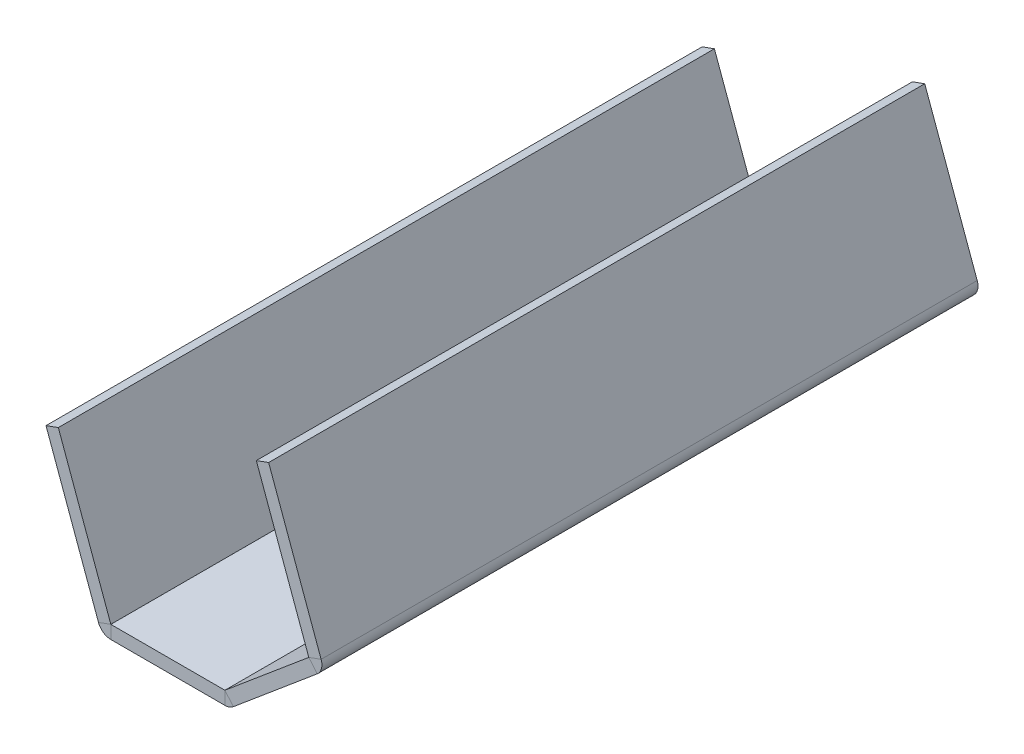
ISO-10303-21;
HEADER;
FILE_DESCRIPTION(('STEP AP214'),'2;1');
FILE_NAME('part.step','',(''),(''),'','','');
FILE_SCHEMA(('AUTOMOTIVE_DESIGN { 1 0 10303 214 1 1 1 1 }'));
ENDSEC;
DATA;
#1=APPLICATION_CONTEXT('core data for automotive mechanical design processes');
#2=APPLICATION_PROTOCOL_DEFINITION('international standard','automotive_design',2000,#1);
#3=PRODUCT_CONTEXT('',#1,'mechanical');
#4=PRODUCT('Part','Part','',(#3));
#5=PRODUCT_RELATED_PRODUCT_CATEGORY('part','',(#4));
#6=PRODUCT_DEFINITION_FORMATION('','',#4);
#7=PRODUCT_DEFINITION_CONTEXT('part definition',#1,'design');
#8=PRODUCT_DEFINITION('design','',#6,#7);
#9=PRODUCT_DEFINITION_SHAPE('','',#8);
#10=(LENGTH_UNIT() NAMED_UNIT(*) SI_UNIT(.MILLI.,.METRE.));
#11=(NAMED_UNIT(*) PLANE_ANGLE_UNIT() SI_UNIT($,.RADIAN.));
#12=(NAMED_UNIT(*) SI_UNIT($,.STERADIAN.) SOLID_ANGLE_UNIT());
#13=UNCERTAINTY_MEASURE_WITH_UNIT(LENGTH_MEASURE(1.E-05),#10,'distance_accuracy_value','');
#14=(GEOMETRIC_REPRESENTATION_CONTEXT(3) GLOBAL_UNCERTAINTY_ASSIGNED_CONTEXT((#13)) GLOBAL_UNIT_ASSIGNED_CONTEXT((#10,
#11,#12)) REPRESENTATION_CONTEXT('',''));
#15=CARTESIAN_POINT('',(0.,0.,0.));
#16=DIRECTION('',(0.,0.,1.));
#17=DIRECTION('',(1.,0.,0.));
#18=AXIS2_PLACEMENT_3D('',#15,#16,#17);
#19=CARTESIAN_POINT('',(20.6579372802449,1.93980959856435,-40.));
#20=DIRECTION('',(0.34202014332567,-0.939692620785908,0.));
#21=DIRECTION('',(0.939692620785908,0.34202014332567,0.));
#22=AXIS2_PLACEMENT_3D('',#19,#20,#21);
#23=CYLINDRICAL_SURFACE('',#22,0.00499999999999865);
#24=CARTESIAN_POINT('',(20.6579372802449,1.93980959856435,-40.));
#25=DIRECTION('',(-0.34202014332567,0.939692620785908,0.));
#26=DIRECTION('',(-0.939692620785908,-0.34202014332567,0.));
#27=AXIS2_PLACEMENT_3D('',#24,#25,#26);
#28=CIRCLE('',#27,0.00499999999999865);
#29=CARTESIAN_POINT('',(20.653238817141,1.93809949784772,-40.));
#30=VERTEX_POINT('',#29);
#31=EDGE_CURVE('E12',#30,#30,#28,.T.);
#32=ORIENTED_EDGE('',*,*,#31,.F.);
#33=EDGE_LOOP('',(#32));
#34=FACE_BOUND('',#33,.T.);
#35=CARTESIAN_POINT('',(20.9999574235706,1.00011697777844,-40.));
#36=DIRECTION('',(-0.34202014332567,0.939692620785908,0.));
#37=DIRECTION('',(-0.939692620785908,-0.34202014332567,0.));
#38=AXIS2_PLACEMENT_3D('',#35,#36,#37);
#39=CIRCLE('',#38,0.00499999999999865);
#40=CARTESIAN_POINT('',(20.9952589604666,0.998406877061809,-40.));
#41=VERTEX_POINT('',#40);
#42=EDGE_CURVE('E83',#41,#41,#39,.T.);
#43=ORIENTED_EDGE('',*,*,#42,.T.);
#44=EDGE_LOOP('',(#43));
#45=FACE_BOUND('',#44,.T.);
#46=ADVANCED_FACE('F80',(#34,#45),#23,.T.);
#47=CARTESIAN_POINT('',(20.6579372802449,1.93980959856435,-40.));
#48=DIRECTION('',(-0.34202014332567,0.939692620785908,0.));
#49=DIRECTION('',(-0.939692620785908,-0.34202014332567,0.));
#50=AXIS2_PLACEMENT_3D('',#47,#48,#49);
#51=PLANE('',#50);
#52=ORIENTED_EDGE('',*,*,#31,.T.);
#53=EDGE_LOOP('',(#52));
#54=FACE_BOUND('',#53,.T.);
#55=ADVANCED_FACE('F95',(#54),#51,.T.);
#56=CARTESIAN_POINT('',(20.9999574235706,1.00011697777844,-40.));
#57=DIRECTION('',(-0.34202014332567,0.939692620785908,0.));
#58=DIRECTION('',(-0.939692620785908,-0.34202014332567,0.));
#59=AXIS2_PLACEMENT_3D('',#56,#57,#58);
#60=PLANE('',#59);
#61=ORIENTED_EDGE('',*,*,#42,.F.);
#62=EDGE_LOOP('',(#61));
#63=FACE_BOUND('',#62,.T.);
#64=ADVANCED_FACE('F93',(#63),#60,.F.);
#65=CLOSED_SHELL('',(#46,#55,#64));
#66=MANIFOLD_SOLID_BREP('B2',#65);
#67=CARTESIAN_POINT('',(20.6579372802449,1.93980959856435,-10.));
#68=DIRECTION('',(0.34202014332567,-0.939692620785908,0.));
#69=DIRECTION('',(0.939692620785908,0.34202014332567,0.));
#70=AXIS2_PLACEMENT_3D('',#67,#68,#69);
#71=CYLINDRICAL_SURFACE('',#70,0.0050000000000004);
#72=CARTESIAN_POINT('',(20.6579372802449,1.93980959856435,-10.));
#73=DIRECTION('',(-0.34202014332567,0.939692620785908,0.));
#74=DIRECTION('',(-0.939692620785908,-0.34202014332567,0.));
#75=AXIS2_PLACEMENT_3D('',#72,#73,#74);
#76=CIRCLE('',#75,0.0050000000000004);
#77=CARTESIAN_POINT('',(20.653238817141,1.93809949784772,-10.));
#78=VERTEX_POINT('',#77);
#79=EDGE_CURVE('E79',#78,#78,#76,.T.);
#80=ORIENTED_EDGE('',*,*,#79,.F.);
#81=EDGE_LOOP('',(#80));
#82=FACE_BOUND('',#81,.T.);
#83=CARTESIAN_POINT('',(20.9999574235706,1.00011697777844,-10.));
#84=DIRECTION('',(-0.34202014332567,0.939692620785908,0.));
#85=DIRECTION('',(-0.939692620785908,-0.34202014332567,0.));
#86=AXIS2_PLACEMENT_3D('',#83,#84,#85);
#87=CIRCLE('',#86,0.0050000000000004);
#88=CARTESIAN_POINT('',(20.9952589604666,0.99840687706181,-10.));
#89=VERTEX_POINT('',#88);
#90=EDGE_CURVE('E133',#89,#89,#87,.T.);
#91=ORIENTED_EDGE('',*,*,#90,.T.);
#92=EDGE_LOOP('',(#91));
#93=FACE_BOUND('',#92,.T.);
#94=ADVANCED_FACE('F130',(#82,#93),#71,.T.);
#95=CARTESIAN_POINT('',(20.6579372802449,1.93980959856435,-10.));
#96=DIRECTION('',(-0.34202014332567,0.939692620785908,0.));
#97=DIRECTION('',(-0.939692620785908,-0.34202014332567,0.));
#98=AXIS2_PLACEMENT_3D('',#95,#96,#97);
#99=PLANE('',#98);
#100=ORIENTED_EDGE('',*,*,#79,.T.);
#101=EDGE_LOOP('',(#100));
#102=FACE_BOUND('',#101,.T.);
#103=ADVANCED_FACE('F145',(#102),#99,.T.);
#104=CARTESIAN_POINT('',(20.9999574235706,1.00011697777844,-10.));
#105=DIRECTION('',(-0.34202014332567,0.939692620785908,0.));
#106=DIRECTION('',(-0.939692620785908,-0.34202014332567,0.));
#107=AXIS2_PLACEMENT_3D('',#104,#105,#106);
#108=PLANE('',#107);
#109=ORIENTED_EDGE('',*,*,#90,.F.);
#110=EDGE_LOOP('',(#109));
#111=FACE_BOUND('',#110,.T.);
#112=ADVANCED_FACE('F143',(#111),#108,.F.);
#113=CLOSED_SHELL('',(#94,#103,#112));
#114=MANIFOLD_SOLID_BREP('B7',#113);
#115=CARTESIAN_POINT('',(4.6456895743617,-12.7228958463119,-50.));
#116=DIRECTION('',(0.,0.,1.));
#117=DIRECTION('',(0.766044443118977,0.642787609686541,0.));
#118=AXIS2_PLACEMENT_3D('',#115,#116,#117);
#119=PLANE('',#118);
#120=DIRECTION('',(-0.766044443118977,-0.64278760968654,0.));
#121=VECTOR('',#120,1.);
#122=CARTESIAN_POINT('',(5.28847718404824,-13.4889402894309,-50.));
#123=LINE('',#122,#121);
#124=CARTESIAN_POINT('',(28.0353675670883,5.59796704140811,-50.));
#125=VERTEX_POINT('',#124);
#126=CARTESIAN_POINT('',(21.6430664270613,0.234189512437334,-50.));
#127=VERTEX_POINT('',#126);
#128=EDGE_CURVE('E703',#125,#127,#123,.T.);
#129=ORIENTED_EDGE('',*,*,#128,.T.);
#130=DIRECTION('',(-0.642787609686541,0.766044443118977,0.));
#131=VECTOR('',#130,1.);
#132=CARTESIAN_POINT('',(21.0002788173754,1.00023395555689,-50.));
#133=LINE('',#132,#131);
#134=CARTESIAN_POINT('',(21.0002788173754,1.00023395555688,-50.));
#135=VERTEX_POINT('',#134);
#136=EDGE_CURVE('E443',#127,#135,#133,.T.);
#137=ORIENTED_EDGE('',*,*,#136,.T.);
#138=DIRECTION('',(-0.766044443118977,-0.64278760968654,0.));
#139=VECTOR('',#138,1.);
#140=CARTESIAN_POINT('',(4.6456895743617,-12.7228958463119,-50.));
#141=LINE('',#140,#139);
#142=CARTESIAN_POINT('',(27.3925799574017,6.36401148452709,-50.));
#143=VERTEX_POINT('',#142);
#144=EDGE_CURVE('E692',#143,#135,#141,.T.);
#145=ORIENTED_EDGE('',*,*,#144,.F.);
#146=DIRECTION('',(-0.642787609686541,0.766044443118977,0.));
#147=VECTOR('',#146,1.);
#148=CARTESIAN_POINT('',(27.3925799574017,6.36401148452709,-50.));
#149=LINE('',#148,#147);
#150=EDGE_CURVE('E444',#125,#143,#149,.T.);
#151=ORIENTED_EDGE('',*,*,#150,.F.);
#152=EDGE_LOOP('',(#129,#137,#145,#151));
#153=FACE_BOUND('',#152,.T.);
#154=ADVANCED_FACE('F170',(#153),#119,.F.);
#155=CARTESIAN_POINT('',(4.6456895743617,-12.7228958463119,0.));
#156=DIRECTION('',(0.,0.,-1.));
#157=DIRECTION('',(-0.766044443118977,-0.642787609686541,0.));
#158=AXIS2_PLACEMENT_3D('',#155,#156,#157);
#159=PLANE('',#158);
#160=DIRECTION('',(0.766044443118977,0.64278760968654,0.));
#161=VECTOR('',#160,1.);
#162=CARTESIAN_POINT('',(4.6456895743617,-12.7228958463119,0.));
#163=LINE('',#162,#161);
#164=CARTESIAN_POINT('',(21.0002788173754,1.00023395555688,0.));
#165=VERTEX_POINT('',#164);
#166=CARTESIAN_POINT('',(27.3925799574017,6.36401148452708,0.));
#167=VERTEX_POINT('',#166);
#168=EDGE_CURVE('E704',#165,#167,#163,.T.);
#169=ORIENTED_EDGE('',*,*,#168,.F.);
#170=DIRECTION('',(0.642787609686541,-0.766044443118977,0.));
#171=VECTOR('',#170,1.);
#172=CARTESIAN_POINT('',(21.0002788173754,1.00023395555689,0.));
#173=LINE('',#172,#171);
#174=CARTESIAN_POINT('',(21.6430664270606,0.23418951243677,0.));
#175=VERTEX_POINT('',#174);
#176=EDGE_CURVE('E128',#165,#175,#173,.T.);
#177=ORIENTED_EDGE('',*,*,#176,.T.);
#178=DIRECTION('',(0.766044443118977,0.64278760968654,0.));
#179=VECTOR('',#178,1.);
#180=CARTESIAN_POINT('',(5.28847718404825,-13.4889402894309,0.));
#181=LINE('',#180,#179);
#182=CARTESIAN_POINT('',(28.0353675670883,5.59796704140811,0.));
#183=VERTEX_POINT('',#182);
#184=EDGE_CURVE('E369',#175,#183,#181,.T.);
#185=ORIENTED_EDGE('',*,*,#184,.T.);
#186=DIRECTION('',(0.642787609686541,-0.766044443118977,0.));
#187=VECTOR('',#186,1.);
#188=CARTESIAN_POINT('',(27.3925799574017,6.36401148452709,0.));
#189=LINE('',#188,#187);
#190=EDGE_CURVE('E691',#167,#183,#189,.T.);
#191=ORIENTED_EDGE('',*,*,#190,.F.);
#192=EDGE_LOOP('',(#169,#177,#185,#191));
#193=FACE_BOUND('',#192,.T.);
#194=ADVANCED_FACE('F423',(#193),#159,.F.);
#195=CARTESIAN_POINT('',(4.6456895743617,-12.7228958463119,-50.));
#196=DIRECTION('',(0.642787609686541,-0.766044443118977,0.));
#197=DIRECTION('',(0.,0.,-1.));
#198=AXIS2_PLACEMENT_3D('',#195,#196,#197);
#199=PLANE('',#198);
#200=ORIENTED_EDGE('',*,*,#144,.T.);
#201=DIRECTION('',(0.,0.,1.));
#202=VECTOR('',#201,1.);
#203=CARTESIAN_POINT('',(21.0002788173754,1.00023395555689,-50.));
#204=LINE('',#203,#202);
#205=CARTESIAN_POINT('',(21.0002788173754,1.00023395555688,-41.7147651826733));
#206=VERTEX_POINT('',#205);
#207=EDGE_CURVE('E366',#135,#206,#204,.T.);
#208=ORIENTED_EDGE('',*,*,#207,.T.);
#209=CARTESIAN_POINT('',(20.7326228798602,0.775643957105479,-40.));
#210=DIRECTION('',(-0.642787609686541,0.766044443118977,0.));
#211=DIRECTION('',(0.,0.,1.));
#212=AXIS2_PLACEMENT_3D('',#209,#210,#211);
#213=CIRCLE('',#212,1.75);
#214=CARTESIAN_POINT('',(21.0002788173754,1.00023395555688,-38.2852348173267));
#215=VERTEX_POINT('',#214);
#216=EDGE_CURVE('E363',#215,#206,#213,.T.);
#217=ORIENTED_EDGE('',*,*,#216,.F.);
#218=DIRECTION('',(0.,0.,1.));
#219=VECTOR('',#218,1.);
#220=CARTESIAN_POINT('',(21.0002788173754,1.00023395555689,-50.));
#221=LINE('',#220,#219);
#222=CARTESIAN_POINT('',(21.0002788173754,1.00023395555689,-11.7147651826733));
#223=VERTEX_POINT('',#222);
#224=EDGE_CURVE('E335',#215,#223,#221,.T.);
#225=ORIENTED_EDGE('',*,*,#224,.T.);
#226=CARTESIAN_POINT('',(20.7326228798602,0.775643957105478,-10.));
#227=DIRECTION('',(-0.642787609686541,0.766044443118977,0.));
#228=DIRECTION('',(0.,0.,1.));
#229=AXIS2_PLACEMENT_3D('',#226,#227,#228);
#230=CIRCLE('',#229,1.75);
#231=CARTESIAN_POINT('',(21.0002788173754,1.00023395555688,-8.28523481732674));
#232=VERTEX_POINT('',#231);
#233=EDGE_CURVE('E389',#232,#223,#230,.T.);
#234=ORIENTED_EDGE('',*,*,#233,.F.);
#235=DIRECTION('',(0.,0.,1.));
#236=VECTOR('',#235,1.);
#237=CARTESIAN_POINT('',(21.0002788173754,1.00023395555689,-50.));
#238=LINE('',#237,#236);
#239=EDGE_CURVE('E410',#232,#165,#238,.T.);
#240=ORIENTED_EDGE('',*,*,#239,.T.);
#241=ORIENTED_EDGE('',*,*,#168,.T.);
#242=DIRECTION('',(0.,0.,1.));
#243=VECTOR('',#242,1.);
#244=CARTESIAN_POINT('',(27.3925799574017,6.36401148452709,-50.));
#245=LINE('',#244,#243);
#246=EDGE_CURVE('E688',#143,#167,#245,.T.);
#247=ORIENTED_EDGE('',*,*,#246,.F.);
#248=EDGE_LOOP('',(#200,#208,#217,#225,#234,#240,#241,#247));
#249=FACE_BOUND('',#248,.T.);
#250=ADVANCED_FACE('F365',(#249),#199,.F.);
#251=CARTESIAN_POINT('',(5.28847718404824,-13.4889402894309,-50.));
#252=DIRECTION('',(0.642787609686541,-0.766044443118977,0.));
#253=DIRECTION('',(0.,0.,-1.));
#254=AXIS2_PLACEMENT_3D('',#251,#252,#253);
#255=PLANE('',#254);
#256=DIRECTION('',(0.,0.,1.));
#257=VECTOR('',#256,1.);
#258=CARTESIAN_POINT('',(21.643066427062,0.234189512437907,-50.));
#259=LINE('',#258,#257);
#260=CARTESIAN_POINT('',(21.6430664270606,0.234189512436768,-41.7147651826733));
#261=VERTEX_POINT('',#260);
#262=EDGE_CURVE('E447',#127,#261,#259,.T.);
#263=ORIENTED_EDGE('',*,*,#262,.F.);
#264=ORIENTED_EDGE('',*,*,#128,.F.);
#265=DIRECTION('',(0.,0.,1.));
#266=VECTOR('',#265,1.);
#267=CARTESIAN_POINT('',(28.0353675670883,5.59796704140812,-50.));
#268=LINE('',#267,#266);
#269=EDGE_CURVE('E695',#125,#183,#268,.T.);
#270=ORIENTED_EDGE('',*,*,#269,.T.);
#271=ORIENTED_EDGE('',*,*,#184,.F.);
#272=DIRECTION('',(0.,0.,1.));
#273=VECTOR('',#272,1.);
#274=CARTESIAN_POINT('',(21.643066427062,0.234189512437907,-50.));
#275=LINE('',#274,#273);
#276=CARTESIAN_POINT('',(21.6430664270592,0.234189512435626,-8.28523481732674));
#277=VERTEX_POINT('',#276);
#278=EDGE_CURVE('E181',#277,#175,#275,.T.);
#279=ORIENTED_EDGE('',*,*,#278,.F.);
#280=CARTESIAN_POINT('',(21.3754104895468,0.00959951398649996,-10.));
#281=DIRECTION('',(-0.642787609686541,0.766044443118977,0.));
#282=DIRECTION('',(0.,0.,1.));
#283=AXIS2_PLACEMENT_3D('',#280,#281,#282);
#284=CIRCLE('',#283,1.75);
#285=CARTESIAN_POINT('',(21.6430664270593,0.234189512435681,-11.7147651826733));
#286=VERTEX_POINT('',#285);
#287=EDGE_CURVE('E396',#277,#286,#284,.T.);
#288=ORIENTED_EDGE('',*,*,#287,.T.);
#289=DIRECTION('',(0.,0.,1.));
#290=VECTOR('',#289,1.);
#291=CARTESIAN_POINT('',(21.643066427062,0.234189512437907,-50.));
#292=LINE('',#291,#290);
#293=CARTESIAN_POINT('',(21.6430664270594,0.234189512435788,-38.2852348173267));
#294=VERTEX_POINT('',#293);
#295=EDGE_CURVE('E376',#294,#286,#292,.T.);
#296=ORIENTED_EDGE('',*,*,#295,.F.);
#297=CARTESIAN_POINT('',(21.3754104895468,0.00959951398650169,-40.));
#298=DIRECTION('',(-0.642787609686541,0.766044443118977,0.));
#299=DIRECTION('',(0.,0.,1.));
#300=AXIS2_PLACEMENT_3D('',#297,#298,#299);
#301=CIRCLE('',#300,1.75);
#302=EDGE_CURVE('E370',#294,#261,#301,.T.);
#303=ORIENTED_EDGE('',*,*,#302,.T.);
#304=EDGE_LOOP('',(#263,#264,#270,#271,#279,#288,#296,#303));
#305=FACE_BOUND('',#304,.T.);
#306=ADVANCED_FACE('F752',(#305),#255,.T.);
#307=CARTESIAN_POINT('',(20.7326228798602,0.775643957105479,-40.));
#308=DIRECTION('',(0.642787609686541,-0.766044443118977,0.));
#309=DIRECTION('',(0.,0.,-1.));
#310=AXIS2_PLACEMENT_3D('',#307,#308,#309);
#311=CYLINDRICAL_SURFACE('',#310,1.75);
#312=CARTESIAN_POINT('',(21.0002788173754,1.00023395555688,-38.2852348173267));
#313=CARTESIAN_POINT('',(21.6430664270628,0.234189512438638,-38.2852348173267));
#314=B_SPLINE_CURVE_WITH_KNOTS('',1,(#312,#313),.UNSPECIFIED.,.F.,.F.,(2,2),(0.,1.),.UNSPECIFIED.);
#315=EDGE_CURVE('E345',#215,#294,#314,.T.);
#316=ORIENTED_EDGE('',*,*,#315,.F.);
#317=ORIENTED_EDGE('',*,*,#216,.T.);
#318=CARTESIAN_POINT('',(21.64306642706,0.234189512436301,-41.7147651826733));
#319=CARTESIAN_POINT('',(21.0002788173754,1.00023395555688,-41.7147651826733));
#320=B_SPLINE_CURVE_WITH_KNOTS('',1,(#318,#319),.UNSPECIFIED.,.F.,.F.,(2,2),(0.,1.),.UNSPECIFIED.);
#321=EDGE_CURVE('E346',#261,#206,#320,.T.);
#322=ORIENTED_EDGE('',*,*,#321,.F.);
#323=ORIENTED_EDGE('',*,*,#302,.F.);
#324=EDGE_LOOP('',(#316,#317,#322,#323));
#325=FACE_BOUND('',#324,.T.);
#326=ADVANCED_FACE('F172',(#325),#311,.F.);
#327=CARTESIAN_POINT('',(20.7326228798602,0.775643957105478,-10.));
#328=DIRECTION('',(0.642787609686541,-0.766044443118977,0.));
#329=DIRECTION('',(0.,0.,-1.));
#330=AXIS2_PLACEMENT_3D('',#327,#328,#329);
#331=CYLINDRICAL_SURFACE('',#330,1.75);
#332=CARTESIAN_POINT('',(21.0002788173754,1.00023395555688,-8.28523481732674));
#333=CARTESIAN_POINT('',(21.6430664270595,0.234189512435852,-8.28523481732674));
#334=B_SPLINE_CURVE_WITH_KNOTS('',1,(#332,#333),.UNSPECIFIED.,.F.,.F.,(2,2),(0.,1.),.UNSPECIFIED.);
#335=EDGE_CURVE('E439',#232,#277,#334,.T.);
#336=ORIENTED_EDGE('',*,*,#335,.F.);
#337=ORIENTED_EDGE('',*,*,#233,.T.);
#338=CARTESIAN_POINT('',(21.6430664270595,0.234189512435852,-11.7147651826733));
#339=CARTESIAN_POINT('',(21.0002788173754,1.00023395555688,-11.7147651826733));
#340=B_SPLINE_CURVE_WITH_KNOTS('',1,(#338,#339),.UNSPECIFIED.,.F.,.F.,(2,2),(0.,1.),.UNSPECIFIED.);
#341=EDGE_CURVE('E393',#286,#223,#340,.T.);
#342=ORIENTED_EDGE('',*,*,#341,.F.);
#343=ORIENTED_EDGE('',*,*,#287,.F.);
#344=EDGE_LOOP('',(#336,#337,#342,#343));
#345=FACE_BOUND('',#344,.T.);
#346=ADVANCED_FACE('F412',(#345),#331,.F.);
#347=CARTESIAN_POINT('',(27.3919371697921,6.36477752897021,-50.));
#348=DIRECTION('',(0.,0.,1.));
#349=DIRECTION('',(0.766044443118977,0.642787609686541,0.));
#350=AXIS2_PLACEMENT_3D('',#347,#348,#349);
#351=PLANE('',#350);
#352=DIRECTION('',(-0.939692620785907,-0.342020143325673,0.));
#353=VECTOR('',#352,1.);
#354=CARTESIAN_POINT('',(27.3928768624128,6.36511954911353,-50.));
#355=LINE('',#354,#353);
#356=CARTESIAN_POINT('',(28.3325694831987,6.70713969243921,-50.));
#357=VERTEX_POINT('',#356);
#358=CARTESIAN_POINT('',(27.3928768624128,6.36511954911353,-50.));
#359=VERTEX_POINT('',#358);
#360=EDGE_CURVE('E652',#357,#359,#355,.T.);
#361=ORIENTED_EDGE('',*,*,#360,.F.);
#362=CARTESIAN_POINT('',(27.3919371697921,6.36477752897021,-50.));
#363=DIRECTION('',(0.,0.,-1.));
#364=DIRECTION('',(-0.766044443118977,-0.642787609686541,0.));
#365=AXIS2_PLACEMENT_3D('',#362,#363,#364);
#366=CIRCLE('',#365,1.001);
#367=EDGE_CURVE('E651',#357,#125,#366,.T.);
#368=ORIENTED_EDGE('',*,*,#367,.T.);
#369=ORIENTED_EDGE('',*,*,#150,.T.);
#370=CARTESIAN_POINT('',(27.3919371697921,6.36477752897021,-50.));
#371=DIRECTION('',(0.,0.,-1.));
#372=DIRECTION('',(-0.766044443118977,-0.642787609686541,0.));
#373=AXIS2_PLACEMENT_3D('',#370,#371,#372);
#374=CIRCLE('',#373,0.000999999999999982);
#375=EDGE_CURVE('E678',#359,#143,#374,.T.);
#376=ORIENTED_EDGE('',*,*,#375,.F.);
#377=EDGE_LOOP('',(#361,#368,#369,#376));
#378=FACE_BOUND('',#377,.T.);
#379=ADVANCED_FACE('F422',(#378),#351,.F.);
#380=CARTESIAN_POINT('',(27.3919371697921,6.36477752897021,0.));
#381=DIRECTION('',(0.,0.,-1.));
#382=DIRECTION('',(-0.766044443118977,-0.642787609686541,0.));
#383=AXIS2_PLACEMENT_3D('',#380,#381,#382);
#384=PLANE('',#383);
#385=ORIENTED_EDGE('',*,*,#190,.T.);
#386=CARTESIAN_POINT('',(27.3919371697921,6.36477752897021,0.));
#387=DIRECTION('',(0.,0.,-1.));
#388=DIRECTION('',(-0.766044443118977,-0.642787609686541,0.));
#389=AXIS2_PLACEMENT_3D('',#386,#387,#388);
#390=CIRCLE('',#389,1.001);
#391=CARTESIAN_POINT('',(28.3325694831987,6.7071396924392,0.));
#392=VERTEX_POINT('',#391);
#393=EDGE_CURVE('E681',#183,#392,#390,.F.);
#394=ORIENTED_EDGE('',*,*,#393,.T.);
#395=DIRECTION('',(0.939692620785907,0.342020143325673,0.));
#396=VECTOR('',#395,1.);
#397=CARTESIAN_POINT('',(27.3928768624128,6.36511954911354,0.));
#398=LINE('',#397,#396);
#399=CARTESIAN_POINT('',(27.3928768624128,6.36511954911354,0.));
#400=VERTEX_POINT('',#399);
#401=EDGE_CURVE('E659',#400,#392,#398,.T.);
#402=ORIENTED_EDGE('',*,*,#401,.F.);
#403=CARTESIAN_POINT('',(27.3919371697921,6.36477752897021,0.));
#404=DIRECTION('',(0.,0.,1.));
#405=DIRECTION('',(0.766044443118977,0.642787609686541,0.));
#406=AXIS2_PLACEMENT_3D('',#403,#404,#405);
#407=CIRCLE('',#406,0.000999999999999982);
#408=EDGE_CURVE('E399',#167,#400,#407,.T.);
#409=ORIENTED_EDGE('',*,*,#408,.F.);
#410=EDGE_LOOP('',(#385,#394,#402,#409));
#411=FACE_BOUND('',#410,.T.);
#412=ADVANCED_FACE('F729',(#411),#384,.F.);
#413=CARTESIAN_POINT('',(27.3919371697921,6.36477752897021,25.0137446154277));
#414=DIRECTION('',(0.,0.,-1.));
#415=DIRECTION('',(-0.766044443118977,-0.642787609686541,0.));
#416=AXIS2_PLACEMENT_3D('',#413,#414,#415);
#417=CYLINDRICAL_SURFACE('',#416,0.001);
#418=ORIENTED_EDGE('',*,*,#408,.T.);
#419=DIRECTION('',(0.,0.,1.));
#420=VECTOR('',#419,1.);
#421=CARTESIAN_POINT('',(27.3928768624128,6.36511954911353,-50.));
#422=LINE('',#421,#420);
#423=EDGE_CURVE('E666',#359,#400,#422,.T.);
#424=ORIENTED_EDGE('',*,*,#423,.F.);
#425=ORIENTED_EDGE('',*,*,#375,.T.);
#426=ORIENTED_EDGE('',*,*,#246,.T.);
#427=EDGE_LOOP('',(#418,#424,#425,#426));
#428=FACE_BOUND('',#427,.T.);
#429=ADVANCED_FACE('F725',(#428),#417,.F.);
#430=CARTESIAN_POINT('',(27.3919371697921,6.36477752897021,25.0137446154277));
#431=DIRECTION('',(0.,0.,-1.));
#432=DIRECTION('',(-0.766044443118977,-0.642787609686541,0.));
#433=AXIS2_PLACEMENT_3D('',#430,#431,#432);
#434=CYLINDRICAL_SURFACE('',#433,1.001);
#435=ORIENTED_EDGE('',*,*,#393,.F.);
#436=ORIENTED_EDGE('',*,*,#269,.F.);
#437=ORIENTED_EDGE('',*,*,#367,.F.);
#438=DIRECTION('',(0.,0.,1.));
#439=VECTOR('',#438,1.);
#440=CARTESIAN_POINT('',(28.3325694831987,6.70713969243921,-50.));
#441=LINE('',#440,#439);
#442=EDGE_CURVE('E510',#357,#392,#441,.T.);
#443=ORIENTED_EDGE('',*,*,#442,.T.);
#444=EDGE_LOOP('',(#435,#436,#437,#443));
#445=FACE_BOUND('',#444,.T.);
#446=ADVANCED_FACE('F750',(#445),#434,.T.);
#447=CARTESIAN_POINT('',(23.3933081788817,17.3538441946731,0.));
#448=DIRECTION('',(0.342020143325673,-0.939692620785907,0.));
#449=DIRECTION('',(0.,0.,1.));
#450=AXIS2_PLACEMENT_3D('',#447,#448,#449);
#451=PLANE('',#450);
#452=DIRECTION('',(0.,0.,-1.));
#453=VECTOR('',#452,1.);
#454=CARTESIAN_POINT('',(24.3330007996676,17.6958643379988,0.));
#455=LINE('',#454,#453);
#456=CARTESIAN_POINT('',(24.3330007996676,17.6958643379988,0.));
#457=VERTEX_POINT('',#456);
#458=CARTESIAN_POINT('',(24.3330007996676,17.6958643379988,-50.));
#459=VERTEX_POINT('',#458);
#460=EDGE_CURVE('E674',#457,#459,#455,.T.);
#461=ORIENTED_EDGE('',*,*,#460,.T.);
#462=DIRECTION('',(0.939692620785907,0.342020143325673,0.));
#463=VECTOR('',#462,1.);
#464=CARTESIAN_POINT('',(23.3933081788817,17.3538441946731,-50.));
#465=LINE('',#464,#463);
#466=CARTESIAN_POINT('',(23.3933081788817,17.3538441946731,-50.));
#467=VERTEX_POINT('',#466);
#468=EDGE_CURVE('E643',#467,#459,#465,.T.);
#469=ORIENTED_EDGE('',*,*,#468,.F.);
#470=DIRECTION('',(0.,0.,-1.));
#471=VECTOR('',#470,1.);
#472=CARTESIAN_POINT('',(23.3933081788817,17.3538441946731,0.));
#473=LINE('',#472,#471);
#474=CARTESIAN_POINT('',(23.3933081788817,17.3538441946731,0.));
#475=VERTEX_POINT('',#474);
#476=EDGE_CURVE('E662',#475,#467,#473,.T.);
#477=ORIENTED_EDGE('',*,*,#476,.F.);
#478=DIRECTION('',(0.939692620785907,0.342020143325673,0.));
#479=VECTOR('',#478,1.);
#480=CARTESIAN_POINT('',(23.3933081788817,17.3538441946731,0.));
#481=LINE('',#480,#479);
#482=EDGE_CURVE('E671',#475,#457,#481,.T.);
#483=ORIENTED_EDGE('',*,*,#482,.T.);
#484=EDGE_LOOP('',(#461,#469,#477,#483));
#485=FACE_BOUND('',#484,.T.);
#486=ADVANCED_FACE('F1131',(#485),#451,.F.);
#487=CARTESIAN_POINT('',(37.7581541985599,-22.113245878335,-50.));
#488=DIRECTION('',(0.939692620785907,0.342020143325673,0.));
#489=DIRECTION('',(0.,0.,-1.));
#490=AXIS2_PLACEMENT_3D('',#487,#488,#489);
#491=PLANE('',#490);
#492=DIRECTION('',(0.342020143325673,-0.939692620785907,0.));
#493=VECTOR('',#492,1.);
#494=CARTESIAN_POINT('',(37.7581541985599,-22.113245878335,-50.));
#495=LINE('',#494,#493);
#496=EDGE_CURVE('E669',#467,#359,#495,.T.);
#497=ORIENTED_EDGE('',*,*,#496,.T.);
#498=ORIENTED_EDGE('',*,*,#423,.T.);
#499=DIRECTION('',(-0.342020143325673,0.939692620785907,0.));
#500=VECTOR('',#499,1.);
#501=CARTESIAN_POINT('',(37.7581541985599,-22.113245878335,0.));
#502=LINE('',#501,#500);
#503=EDGE_CURVE('E664',#400,#475,#502,.T.);
#504=ORIENTED_EDGE('',*,*,#503,.T.);
#505=ORIENTED_EDGE('',*,*,#476,.T.);
#506=EDGE_LOOP('',(#497,#498,#504,#505));
#507=FACE_BOUND('',#506,.T.);
#508=ADVANCED_FACE('F735',(#507),#491,.F.);
#509=CARTESIAN_POINT('',(37.7581541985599,-22.113245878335,0.));
#510=DIRECTION('',(0.,0.,-1.));
#511=DIRECTION('',(0.342020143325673,-0.939692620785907,0.));
#512=AXIS2_PLACEMENT_3D('',#509,#510,#511);
#513=PLANE('',#512);
#514=ORIENTED_EDGE('',*,*,#503,.F.);
#515=ORIENTED_EDGE('',*,*,#401,.T.);
#516=DIRECTION('',(-0.342020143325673,0.939692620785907,0.));
#517=VECTOR('',#516,1.);
#518=CARTESIAN_POINT('',(38.6978468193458,-21.7712257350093,0.));
#519=LINE('',#518,#517);
#520=EDGE_CURVE('E657',#392,#457,#519,.T.);
#521=ORIENTED_EDGE('',*,*,#520,.T.);
#522=ORIENTED_EDGE('',*,*,#482,.F.);
#523=EDGE_LOOP('',(#514,#515,#521,#522));
#524=FACE_BOUND('',#523,.T.);
#525=ADVANCED_FACE('F731',(#524),#513,.F.);
#526=CARTESIAN_POINT('',(38.6978468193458,-21.7712257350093,-50.));
#527=DIRECTION('',(0.939692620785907,0.342020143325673,0.));
#528=DIRECTION('',(0.,0.,-1.));
#529=AXIS2_PLACEMENT_3D('',#526,#527,#528);
#530=PLANE('',#529);
#531=ORIENTED_EDGE('',*,*,#442,.F.);
#532=DIRECTION('',(0.342020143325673,-0.939692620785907,0.));
#533=VECTOR('',#532,1.);
#534=CARTESIAN_POINT('',(38.6978468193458,-21.7712257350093,-50.));
#535=LINE('',#534,#533);
#536=EDGE_CURVE('E655',#459,#357,#535,.T.);
#537=ORIENTED_EDGE('',*,*,#536,.F.);
#538=ORIENTED_EDGE('',*,*,#460,.F.);
#539=ORIENTED_EDGE('',*,*,#520,.F.);
#540=EDGE_LOOP('',(#531,#537,#538,#539));
#541=FACE_BOUND('',#540,.T.);
#542=ADVANCED_FACE('F1111',(#541),#530,.T.);
#543=CARTESIAN_POINT('',(37.7581541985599,-22.113245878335,-50.));
#544=DIRECTION('',(0.,0.,1.));
#545=DIRECTION('',(-0.342020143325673,0.939692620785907,0.));
#546=AXIS2_PLACEMENT_3D('',#543,#544,#545);
#547=PLANE('',#546);
#548=ORIENTED_EDGE('',*,*,#536,.T.);
#549=ORIENTED_EDGE('',*,*,#360,.T.);
#550=ORIENTED_EDGE('',*,*,#496,.F.);
#551=ORIENTED_EDGE('',*,*,#468,.T.);
#552=EDGE_LOOP('',(#548,#549,#550,#551));
#553=FACE_BOUND('',#552,.T.);
#554=ADVANCED_FACE('F740',(#553),#547,.F.);
#555=CARTESIAN_POINT('',(8.30553510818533,11.9893826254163,0.));
#556=DIRECTION('',(0.342020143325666,-0.93969262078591,0.));
#557=DIRECTION('',(0.,0.,-1.));
#558=AXIS2_PLACEMENT_3D('',#555,#556,#557);
#559=PLANE('',#558);
#560=DIRECTION('',(0.,0.,1.));
#561=VECTOR('',#560,1.);
#562=CARTESIAN_POINT('',(7.36584248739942,11.6473624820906,0.));
#563=LINE('',#562,#561);
#564=CARTESIAN_POINT('',(7.36584248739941,11.6473624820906,-50.));
#565=VERTEX_POINT('',#564);
#566=CARTESIAN_POINT('',(7.36584248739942,11.6473624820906,0.));
#567=VERTEX_POINT('',#566);
#568=EDGE_CURVE('E573',#565,#567,#563,.T.);
#569=ORIENTED_EDGE('',*,*,#568,.T.);
#570=DIRECTION('',(-0.93969262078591,-0.342020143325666,0.));
#571=VECTOR('',#570,1.);
#572=CARTESIAN_POINT('',(8.30553510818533,11.9893826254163,0.));
#573=LINE('',#572,#571);
#574=CARTESIAN_POINT('',(8.30553510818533,11.9893826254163,0.));
#575=VERTEX_POINT('',#574);
#576=EDGE_CURVE('E567',#575,#567,#573,.T.);
#577=ORIENTED_EDGE('',*,*,#576,.F.);
#578=DIRECTION('',(0.,0.,1.));
#579=VECTOR('',#578,1.);
#580=CARTESIAN_POINT('',(8.30553510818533,11.9893826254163,0.));
#581=LINE('',#580,#579);
#582=CARTESIAN_POINT('',(8.30553510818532,11.9893826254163,-50.));
#583=VERTEX_POINT('',#582);
#584=EDGE_CURVE('E555',#583,#575,#581,.T.);
#585=ORIENTED_EDGE('',*,*,#584,.F.);
#586=DIRECTION('',(-0.93969262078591,-0.342020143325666,0.));
#587=VECTOR('',#586,1.);
#588=CARTESIAN_POINT('',(8.30553510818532,11.9893826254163,-50.));
#589=LINE('',#588,#587);
#590=EDGE_CURVE('E570',#583,#565,#589,.T.);
#591=ORIENTED_EDGE('',*,*,#590,.T.);
#592=EDGE_LOOP('',(#569,#577,#585,#591));
#593=FACE_BOUND('',#592,.T.);
#594=ADVANCED_FACE('F486',(#593),#559,.F.);
#595=CARTESIAN_POINT('',(8.30553510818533,11.9893826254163,0.));
#596=DIRECTION('',(0.,0.,-1.));
#597=DIRECTION('',(-0.342020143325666,0.93969262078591,0.));
#598=AXIS2_PLACEMENT_3D('',#595,#596,#597);
#599=PLANE('',#598);
#600=DIRECTION('',(-0.93969262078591,-0.342020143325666,0.));
#601=VECTOR('',#600,1.);
#602=CARTESIAN_POINT('',(12.3051037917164,1.00065797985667,0.));
#603=LINE('',#602,#601);
#604=CARTESIAN_POINT('',(12.3051037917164,1.00065797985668,0.));
#605=VERTEX_POINT('',#604);
#606=CARTESIAN_POINT('',(11.3654111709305,0.658637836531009,0.));
#607=VERTEX_POINT('',#606);
#608=EDGE_CURVE('E549',#605,#607,#603,.T.);
#609=ORIENTED_EDGE('',*,*,#608,.F.);
#610=DIRECTION('',(0.342020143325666,-0.939692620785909,0.));
#611=VECTOR('',#610,1.);
#612=CARTESIAN_POINT('',(8.30553510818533,11.9893826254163,0.));
#613=LINE('',#612,#611);
#614=EDGE_CURVE('E552',#575,#605,#613,.T.);
#615=ORIENTED_EDGE('',*,*,#614,.F.);
#616=ORIENTED_EDGE('',*,*,#576,.T.);
#617=DIRECTION('',(0.342020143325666,-0.939692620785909,0.));
#618=VECTOR('',#617,1.);
#619=CARTESIAN_POINT('',(7.36584248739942,11.6473624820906,0.));
#620=LINE('',#619,#618);
#621=EDGE_CURVE('E565',#567,#607,#620,.T.);
#622=ORIENTED_EDGE('',*,*,#621,.T.);
#623=EDGE_LOOP('',(#609,#615,#616,#622));
#624=FACE_BOUND('',#623,.T.);
#625=ADVANCED_FACE('F830',(#624),#599,.F.);
#626=CARTESIAN_POINT('',(7.36584248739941,11.6473624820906,-50.));
#627=DIRECTION('',(-0.93969262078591,-0.342020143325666,0.));
#628=DIRECTION('',(0.,0.,-1.));
#629=AXIS2_PLACEMENT_3D('',#626,#627,#628);
#630=PLANE('',#629);
#631=DIRECTION('',(-0.342020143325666,0.939692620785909,0.));
#632=VECTOR('',#631,1.);
#633=CARTESIAN_POINT('',(7.36584248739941,11.6473624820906,-50.));
#634=LINE('',#633,#632);
#635=CARTESIAN_POINT('',(11.3654111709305,0.658637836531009,-50.));
#636=VERTEX_POINT('',#635);
#637=EDGE_CURVE('E560',#636,#565,#634,.T.);
#638=ORIENTED_EDGE('',*,*,#637,.F.);
#639=DIRECTION('',(0.,0.,1.));
#640=VECTOR('',#639,1.);
#641=CARTESIAN_POINT('',(11.3654111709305,0.658637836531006,-50.));
#642=LINE('',#641,#640);
#643=EDGE_CURVE('E562',#636,#607,#642,.T.);
#644=ORIENTED_EDGE('',*,*,#643,.T.);
#645=ORIENTED_EDGE('',*,*,#621,.F.);
#646=ORIENTED_EDGE('',*,*,#568,.F.);
#647=EDGE_LOOP('',(#638,#644,#645,#646));
#648=FACE_BOUND('',#647,.T.);
#649=ADVANCED_FACE('F839',(#648),#630,.T.);
#650=CARTESIAN_POINT('',(8.30553510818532,11.9893826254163,-50.));
#651=DIRECTION('',(0.,0.,1.));
#652=DIRECTION('',(0.342020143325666,-0.93969262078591,0.));
#653=AXIS2_PLACEMENT_3D('',#650,#651,#652);
#654=PLANE('',#653);
#655=DIRECTION('',(0.93969262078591,0.342020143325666,0.));
#656=VECTOR('',#655,1.);
#657=CARTESIAN_POINT('',(12.3051037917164,1.00065797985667,-50.));
#658=LINE('',#657,#656);
#659=CARTESIAN_POINT('',(12.3051037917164,1.00065797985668,-50.));
#660=VERTEX_POINT('',#659);
#661=EDGE_CURVE('E538',#636,#660,#658,.T.);
#662=ORIENTED_EDGE('',*,*,#661,.F.);
#663=ORIENTED_EDGE('',*,*,#637,.T.);
#664=ORIENTED_EDGE('',*,*,#590,.F.);
#665=DIRECTION('',(-0.342020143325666,0.939692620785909,0.));
#666=VECTOR('',#665,1.);
#667=CARTESIAN_POINT('',(8.30553510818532,11.9893826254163,-50.));
#668=LINE('',#667,#666);
#669=EDGE_CURVE('E558',#660,#583,#668,.T.);
#670=ORIENTED_EDGE('',*,*,#669,.F.);
#671=EDGE_LOOP('',(#662,#663,#664,#670));
#672=FACE_BOUND('',#671,.T.);
#673=ADVANCED_FACE('F848',(#672),#654,.F.);
#674=CARTESIAN_POINT('',(8.30553510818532,11.9893826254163,-50.));
#675=DIRECTION('',(-0.93969262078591,-0.342020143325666,0.));
#676=DIRECTION('',(0.,0.,-1.));
#677=AXIS2_PLACEMENT_3D('',#674,#675,#676);
#678=PLANE('',#677);
#679=DIRECTION('',(0.,0.,1.));
#680=VECTOR('',#679,1.);
#681=CARTESIAN_POINT('',(12.3051037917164,1.00065797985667,-50.));
#682=LINE('',#681,#680);
#683=EDGE_CURVE('E529',#660,#605,#682,.T.);
#684=ORIENTED_EDGE('',*,*,#683,.F.);
#685=ORIENTED_EDGE('',*,*,#669,.T.);
#686=ORIENTED_EDGE('',*,*,#584,.T.);
#687=ORIENTED_EDGE('',*,*,#614,.T.);
#688=EDGE_LOOP('',(#684,#685,#686,#687));
#689=FACE_BOUND('',#688,.T.);
#690=ADVANCED_FACE('F858',(#689),#678,.F.);
#691=CARTESIAN_POINT('',(12.3060434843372,1.001,0.));
#692=DIRECTION('',(0.,0.,-1.));
#693=DIRECTION('',(-1.,0.,0.));
#694=AXIS2_PLACEMENT_3D('',#691,#692,#693);
#695=PLANE('',#694);
#696=ORIENTED_EDGE('',*,*,#608,.T.);
#697=CARTESIAN_POINT('',(12.3060434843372,1.001,0.));
#698=DIRECTION('',(0.,0.,1.));
#699=DIRECTION('',(1.,0.,0.));
#700=AXIS2_PLACEMENT_3D('',#697,#698,#699);
#701=CIRCLE('',#700,1.001);
#702=CARTESIAN_POINT('',(12.3060434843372,0.,0.));
#703=VERTEX_POINT('',#702);
#704=EDGE_CURVE('E546',#607,#703,#701,.T.);
#705=ORIENTED_EDGE('',*,*,#704,.T.);
#706=DIRECTION('',(0.,-1.,0.));
#707=VECTOR('',#706,1.);
#708=CARTESIAN_POINT('',(12.3060434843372,1.,0.));
#709=LINE('',#708,#707);
#710=CARTESIAN_POINT('',(12.3060434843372,1.,0.));
#711=VERTEX_POINT('',#710);
#712=EDGE_CURVE('E511',#711,#703,#709,.T.);
#713=ORIENTED_EDGE('',*,*,#712,.F.);
#714=CARTESIAN_POINT('',(12.3060434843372,1.001,0.));
#715=DIRECTION('',(0.,0.,1.));
#716=DIRECTION('',(1.,0.,0.));
#717=AXIS2_PLACEMENT_3D('',#714,#715,#716);
#718=CIRCLE('',#717,0.000999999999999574);
#719=EDGE_CURVE('E535',#605,#711,#718,.T.);
#720=ORIENTED_EDGE('',*,*,#719,.F.);
#721=EDGE_LOOP('',(#696,#705,#713,#720));
#722=FACE_BOUND('',#721,.T.);
#723=ADVANCED_FACE('F868',(#722),#695,.F.);
#724=CARTESIAN_POINT('',(12.3060434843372,1.001,-75.0137446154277));
#725=DIRECTION('',(0.,0.,1.));
#726=DIRECTION('',(1.,0.,0.));
#727=AXIS2_PLACEMENT_3D('',#724,#725,#726);
#728=CYLINDRICAL_SURFACE('',#727,1.001);
#729=ORIENTED_EDGE('',*,*,#704,.F.);
#730=ORIENTED_EDGE('',*,*,#643,.F.);
#731=CARTESIAN_POINT('',(12.3060434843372,1.001,-50.));
#732=DIRECTION('',(0.,0.,1.));
#733=DIRECTION('',(1.,0.,0.));
#734=AXIS2_PLACEMENT_3D('',#731,#732,#733);
#735=CIRCLE('',#734,1.001);
#736=CARTESIAN_POINT('',(12.3060434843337,0.,-50.));
#737=VERTEX_POINT('',#736);
#738=EDGE_CURVE('E541',#737,#636,#735,.F.);
#739=ORIENTED_EDGE('',*,*,#738,.F.);
#740=DIRECTION('',(0.,0.,1.));
#741=VECTOR('',#740,1.);
#742=CARTESIAN_POINT('',(12.3060434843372,0.,-50.));
#743=LINE('',#742,#741);
#744=EDGE_CURVE('E544',#737,#703,#743,.T.);
#745=ORIENTED_EDGE('',*,*,#744,.T.);
#746=EDGE_LOOP('',(#729,#730,#739,#745));
#747=FACE_BOUND('',#746,.T.);
#748=ADVANCED_FACE('F878',(#747),#728,.T.);
#749=CARTESIAN_POINT('',(12.3060434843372,1.001,-50.));
#750=DIRECTION('',(0.,0.,1.));
#751=DIRECTION('',(1.,0.,0.));
#752=AXIS2_PLACEMENT_3D('',#749,#750,#751);
#753=PLANE('',#752);
#754=DIRECTION('',(0.,1.,0.));
#755=VECTOR('',#754,1.);
#756=CARTESIAN_POINT('',(12.3060434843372,1.,-50.));
#757=LINE('',#756,#755);
#758=CARTESIAN_POINT('',(12.3060434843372,1.,-50.));
#759=VERTEX_POINT('',#758);
#760=EDGE_CURVE('E515',#737,#759,#757,.T.);
#761=ORIENTED_EDGE('',*,*,#760,.F.);
#762=ORIENTED_EDGE('',*,*,#738,.T.);
#763=ORIENTED_EDGE('',*,*,#661,.T.);
#764=CARTESIAN_POINT('',(12.3060434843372,1.001,-50.));
#765=DIRECTION('',(0.,0.,-1.));
#766=DIRECTION('',(-1.,0.,0.));
#767=AXIS2_PLACEMENT_3D('',#764,#765,#766);
#768=CIRCLE('',#767,0.000999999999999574);
#769=EDGE_CURVE('E532',#759,#660,#768,.T.);
#770=ORIENTED_EDGE('',*,*,#769,.F.);
#771=EDGE_LOOP('',(#761,#762,#763,#770));
#772=FACE_BOUND('',#771,.T.);
#773=ADVANCED_FACE('F888',(#772),#753,.F.);
#774=CARTESIAN_POINT('',(12.3060434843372,1.001,-75.0137446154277));
#775=DIRECTION('',(0.,0.,1.));
#776=DIRECTION('',(1.,0.,0.));
#777=AXIS2_PLACEMENT_3D('',#774,#775,#776);
#778=CYLINDRICAL_SURFACE('',#777,0.001);
#779=ORIENTED_EDGE('',*,*,#719,.T.);
#780=DIRECTION('',(0.,0.,1.));
#781=VECTOR('',#780,1.);
#782=CARTESIAN_POINT('',(12.3060434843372,1.,-50.));
#783=LINE('',#782,#781);
#784=EDGE_CURVE('E524',#759,#711,#783,.T.);
#785=ORIENTED_EDGE('',*,*,#784,.F.);
#786=ORIENTED_EDGE('',*,*,#769,.T.);
#787=ORIENTED_EDGE('',*,*,#683,.T.);
#788=EDGE_LOOP('',(#779,#785,#786,#787));
#789=FACE_BOUND('',#788,.T.);
#790=ADVANCED_FACE('F898',(#789),#778,.F.);
#791=CARTESIAN_POINT('',(0.,1.,-50.));
#792=DIRECTION('',(0.,-1.,0.));
#793=DIRECTION('',(0.,0.,-1.));
#794=AXIS2_PLACEMENT_3D('',#791,#792,#793);
#795=PLANE('',#794);
#796=DIRECTION('',(0.,0.,1.));
#797=VECTOR('',#796,1.);
#798=CARTESIAN_POINT('',(20.9996360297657,1.,-50.));
#799=LINE('',#798,#797);
#800=CARTESIAN_POINT('',(20.9996360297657,1.,-50.));
#801=VERTEX_POINT('',#800);
#802=CARTESIAN_POINT('',(20.9996360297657,1.,-41.7499999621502));
#803=VERTEX_POINT('',#802);
#804=EDGE_CURVE('E579',#801,#803,#799,.T.);
#805=ORIENTED_EDGE('',*,*,#804,.F.);
#806=DIRECTION('',(-1.,0.,0.));
#807=VECTOR('',#806,1.);
#808=CARTESIAN_POINT('',(0.,1.,-50.));
#809=LINE('',#808,#807);
#810=EDGE_CURVE('E527',#801,#759,#809,.T.);
#811=ORIENTED_EDGE('',*,*,#810,.T.);
#812=ORIENTED_EDGE('',*,*,#784,.T.);
#813=DIRECTION('',(1.,0.,0.));
#814=VECTOR('',#813,1.);
#815=CARTESIAN_POINT('',(0.,1.,0.));
#816=LINE('',#815,#814);
#817=CARTESIAN_POINT('',(20.9996360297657,1.,0.));
#818=VERTEX_POINT('',#817);
#819=EDGE_CURVE('E521',#711,#818,#816,.T.);
#820=ORIENTED_EDGE('',*,*,#819,.T.);
#821=DIRECTION('',(0.,0.,1.));
#822=VECTOR('',#821,1.);
#823=CARTESIAN_POINT('',(20.9996360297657,1.,-50.));
#824=LINE('',#823,#822);
#825=CARTESIAN_POINT('',(20.9996360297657,1.,-8.25000003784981));
#826=VERTEX_POINT('',#825);
#827=EDGE_CURVE('E582',#826,#818,#824,.T.);
#828=ORIENTED_EDGE('',*,*,#827,.F.);
#829=CARTESIAN_POINT('',(21.,1.,-10.));
#830=DIRECTION('',(0.,1.,0.));
#831=DIRECTION('',(0.,0.,1.));
#832=AXIS2_PLACEMENT_3D('',#829,#830,#831);
#833=CIRCLE('',#832,1.75);
#834=CARTESIAN_POINT('',(20.9996360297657,1.,-11.7499999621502));
#835=VERTEX_POINT('',#834);
#836=EDGE_CURVE('E1398',#835,#826,#833,.T.);
#837=ORIENTED_EDGE('',*,*,#836,.F.);
#838=DIRECTION('',(0.,0.,1.));
#839=VECTOR('',#838,1.);
#840=CARTESIAN_POINT('',(20.9996360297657,1.,-50.));
#841=LINE('',#840,#839);
#842=CARTESIAN_POINT('',(20.9996360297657,1.,-38.2500000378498));
#843=VERTEX_POINT('',#842);
#844=EDGE_CURVE('E626',#843,#835,#841,.T.);
#845=ORIENTED_EDGE('',*,*,#844,.F.);
#846=CARTESIAN_POINT('',(21.,1.,-40.));
#847=DIRECTION('',(0.,1.,0.));
#848=DIRECTION('',(0.,0.,1.));
#849=AXIS2_PLACEMENT_3D('',#846,#847,#848);
#850=CIRCLE('',#849,1.75);
#851=EDGE_CURVE('E1370',#803,#843,#850,.T.);
#852=ORIENTED_EDGE('',*,*,#851,.F.);
#853=EDGE_LOOP('',(#805,#811,#812,#820,#828,#837,#845,#852));
#854=FACE_BOUND('',#853,.T.);
#855=ADVANCED_FACE('F908',(#854),#795,.F.);
#856=CARTESIAN_POINT('',(0.,1.,-50.));
#857=DIRECTION('',(0.,0.,1.));
#858=DIRECTION('',(1.,0.,0.));
#859=AXIS2_PLACEMENT_3D('',#856,#857,#858);
#860=PLANE('',#859);
#861=DIRECTION('',(0.,1.,0.));
#862=VECTOR('',#861,1.);
#863=CARTESIAN_POINT('',(20.9996360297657,1.,-50.));
#864=LINE('',#863,#862);
#865=CARTESIAN_POINT('',(20.9996360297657,0.,-50.));
#866=VERTEX_POINT('',#865);
#867=EDGE_CURVE('E576',#866,#801,#864,.T.);
#868=ORIENTED_EDGE('',*,*,#867,.F.);
#869=DIRECTION('',(-1.,0.,0.));
#870=VECTOR('',#869,1.);
#871=CARTESIAN_POINT('',(0.,0.,-50.));
#872=LINE('',#871,#870);
#873=EDGE_CURVE('E519',#866,#737,#872,.T.);
#874=ORIENTED_EDGE('',*,*,#873,.T.);
#875=ORIENTED_EDGE('',*,*,#760,.T.);
#876=ORIENTED_EDGE('',*,*,#810,.F.);
#877=EDGE_LOOP('',(#868,#874,#875,#876));
#878=FACE_BOUND('',#877,.T.);
#879=ADVANCED_FACE('F919',(#878),#860,.F.);
#880=CARTESIAN_POINT('',(0.,0.,-50.));
#881=DIRECTION('',(0.,-1.,0.));
#882=DIRECTION('',(0.,0.,-1.));
#883=AXIS2_PLACEMENT_3D('',#880,#881,#882);
#884=PLANE('',#883);
#885=ORIENTED_EDGE('',*,*,#873,.F.);
#886=DIRECTION('',(0.,0.,1.));
#887=VECTOR('',#886,1.);
#888=CARTESIAN_POINT('',(20.9996360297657,0.,-50.));
#889=LINE('',#888,#887);
#890=CARTESIAN_POINT('',(20.9996360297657,0.,-41.7499999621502));
#891=VERTEX_POINT('',#890);
#892=EDGE_CURVE('E518',#866,#891,#889,.T.);
#893=ORIENTED_EDGE('',*,*,#892,.T.);
#894=CARTESIAN_POINT('',(21.,0.,-40.));
#895=DIRECTION('',(0.,1.,0.));
#896=DIRECTION('',(0.,0.,1.));
#897=AXIS2_PLACEMENT_3D('',#894,#895,#896);
#898=CIRCLE('',#897,1.75);
#899=CARTESIAN_POINT('',(20.9996360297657,0.,-38.2500000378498));
#900=VERTEX_POINT('',#899);
#901=EDGE_CURVE('E583',#891,#900,#898,.T.);
#902=ORIENTED_EDGE('',*,*,#901,.T.);
#903=DIRECTION('',(0.,0.,1.));
#904=VECTOR('',#903,1.);
#905=CARTESIAN_POINT('',(20.9996360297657,0.,-50.));
#906=LINE('',#905,#904);
#907=CARTESIAN_POINT('',(20.9996360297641,0.,-11.7499999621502));
#908=VERTEX_POINT('',#907);
#909=EDGE_CURVE('E586',#900,#908,#906,.T.);
#910=ORIENTED_EDGE('',*,*,#909,.T.);
#911=CARTESIAN_POINT('',(21.,0.,-10.));
#912=DIRECTION('',(0.,1.,0.));
#913=DIRECTION('',(0.,0.,1.));
#914=AXIS2_PLACEMENT_3D('',#911,#912,#913);
#915=CIRCLE('',#914,1.75);
#916=CARTESIAN_POINT('',(20.9996360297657,0.,-8.25000003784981));
#917=VERTEX_POINT('',#916);
#918=EDGE_CURVE('E1374',#908,#917,#915,.T.);
#919=ORIENTED_EDGE('',*,*,#918,.T.);
#920=DIRECTION('',(0.,0.,1.));
#921=VECTOR('',#920,1.);
#922=CARTESIAN_POINT('',(20.9996360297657,0.,-50.));
#923=LINE('',#922,#921);
#924=CARTESIAN_POINT('',(20.9996360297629,0.,0.));
#925=VERTEX_POINT('',#924);
#926=EDGE_CURVE('E1371',#917,#925,#923,.T.);
#927=ORIENTED_EDGE('',*,*,#926,.T.);
#928=DIRECTION('',(1.,0.,0.));
#929=VECTOR('',#928,1.);
#930=CARTESIAN_POINT('',(0.,0.,0.));
#931=LINE('',#930,#929);
#932=EDGE_CURVE('E502',#703,#925,#931,.T.);
#933=ORIENTED_EDGE('',*,*,#932,.F.);
#934=ORIENTED_EDGE('',*,*,#744,.F.);
#935=EDGE_LOOP('',(#885,#893,#902,#910,#919,#927,#933,#934));
#936=FACE_BOUND('',#935,.T.);
#937=ADVANCED_FACE('F615',(#936),#884,.T.);
#938=CARTESIAN_POINT('',(21.,1.,-40.));
#939=DIRECTION('',(0.,-1.,0.));
#940=DIRECTION('',(0.,0.,-1.));
#941=AXIS2_PLACEMENT_3D('',#938,#939,#940);
#942=CYLINDRICAL_SURFACE('',#941,1.75);
#943=ORIENTED_EDGE('',*,*,#851,.T.);
#944=CARTESIAN_POINT('',(20.9996360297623,0.,-38.2500000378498));
#945=CARTESIAN_POINT('',(20.9996360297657,1.,-38.2500000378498));
#946=B_SPLINE_CURVE_WITH_KNOTS('',1,(#944,#945),.UNSPECIFIED.,.F.,.F.,(2,2),(0.,1.),.UNSPECIFIED.);
#947=EDGE_CURVE('E355',#843,#900,#946,.F.);
#948=ORIENTED_EDGE('',*,*,#947,.T.);
#949=ORIENTED_EDGE('',*,*,#901,.F.);
#950=CARTESIAN_POINT('',(20.9996360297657,1.,-41.7499999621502));
#951=CARTESIAN_POINT('',(20.9996360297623,0.,-41.7499999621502));
#952=B_SPLINE_CURVE_WITH_KNOTS('',1,(#950,#951),.UNSPECIFIED.,.F.,.F.,(2,2),(0.,1.),.UNSPECIFIED.);
#953=EDGE_CURVE('E597',#891,#803,#952,.F.);
#954=ORIENTED_EDGE('',*,*,#953,.T.);
#955=EDGE_LOOP('',(#943,#948,#949,#954));
#956=FACE_BOUND('',#955,.T.);
#957=ADVANCED_FACE('F604',(#956),#942,.F.);
#958=CARTESIAN_POINT('',(21.,1.,-10.));
#959=DIRECTION('',(0.,-1.,0.));
#960=DIRECTION('',(0.,0.,-1.));
#961=AXIS2_PLACEMENT_3D('',#958,#959,#960);
#962=CYLINDRICAL_SURFACE('',#961,1.75);
#963=ORIENTED_EDGE('',*,*,#836,.T.);
#964=CARTESIAN_POINT('',(20.9996360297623,0.,-8.25000003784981));
#965=CARTESIAN_POINT('',(20.9996360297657,1.,-8.25000003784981));
#966=B_SPLINE_CURVE_WITH_KNOTS('',1,(#964,#965),.UNSPECIFIED.,.F.,.F.,(2,2),(0.,1.),.UNSPECIFIED.);
#967=EDGE_CURVE('E1356',#826,#917,#966,.F.);
#968=ORIENTED_EDGE('',*,*,#967,.T.);
#969=ORIENTED_EDGE('',*,*,#918,.F.);
#970=CARTESIAN_POINT('',(20.9996360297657,1.,-11.7499999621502));
#971=CARTESIAN_POINT('',(20.9996360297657,0.,-11.7499999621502));
#972=B_SPLINE_CURVE_WITH_KNOTS('',1,(#970,#971),.UNSPECIFIED.,.F.,.F.,(2,2),(0.,1.),.UNSPECIFIED.);
#973=EDGE_CURVE('E514',#908,#835,#972,.F.);
#974=ORIENTED_EDGE('',*,*,#973,.T.);
#975=EDGE_LOOP('',(#963,#968,#969,#974));
#976=FACE_BOUND('',#975,.T.);
#977=ADVANCED_FACE('F614',(#976),#962,.F.);
#978=CARTESIAN_POINT('',(0.,1.,0.));
#979=DIRECTION('',(0.,0.,-1.));
#980=DIRECTION('',(-1.,0.,0.));
#981=AXIS2_PLACEMENT_3D('',#978,#979,#980);
#982=PLANE('',#981);
#983=DIRECTION('',(0.,-1.,0.));
#984=VECTOR('',#983,1.);
#985=CARTESIAN_POINT('',(20.9996360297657,1.,0.));
#986=LINE('',#985,#984);
#987=EDGE_CURVE('E580',#818,#925,#986,.T.);
#988=ORIENTED_EDGE('',*,*,#987,.F.);
#989=ORIENTED_EDGE('',*,*,#819,.F.);
#990=ORIENTED_EDGE('',*,*,#712,.T.);
#991=ORIENTED_EDGE('',*,*,#932,.T.);
#992=EDGE_LOOP('',(#988,#989,#990,#991));
#993=FACE_BOUND('',#992,.T.);
#994=ADVANCED_FACE('F956',(#993),#982,.F.);
#995=CARTESIAN_POINT('',(20.9996360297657,1.001,-50.));
#996=DIRECTION('',(0.,0.,1.));
#997=DIRECTION('',(1.,0.,0.));
#998=AXIS2_PLACEMENT_3D('',#995,#996,#997);
#999=PLANE('',#998);
#1000=ORIENTED_EDGE('',*,*,#136,.F.);
#1001=CARTESIAN_POINT('',(20.9996360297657,1.001,-50.));
#1002=DIRECTION('',(0.,0.,-1.));
#1003=DIRECTION('',(-1.,0.,0.));
#1004=AXIS2_PLACEMENT_3D('',#1001,#1002,#1003);
#1005=CIRCLE('',#1004,1.001);
#1006=EDGE_CURVE('E759',#127,#866,#1005,.T.);
#1007=ORIENTED_EDGE('',*,*,#1006,.T.);
#1008=ORIENTED_EDGE('',*,*,#867,.T.);
#1009=CARTESIAN_POINT('',(20.9996360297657,1.001,-50.));
#1010=DIRECTION('',(0.,0.,-1.));
#1011=DIRECTION('',(-1.,0.,0.));
#1012=AXIS2_PLACEMENT_3D('',#1009,#1010,#1011);
#1013=CIRCLE('',#1012,0.000999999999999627);
#1014=EDGE_CURVE('E762',#135,#801,#1013,.T.);
#1015=ORIENTED_EDGE('',*,*,#1014,.F.);
#1016=EDGE_LOOP('',(#1000,#1007,#1008,#1015));
#1017=FACE_BOUND('',#1016,.T.);
#1018=ADVANCED_FACE('F483',(#1017),#999,.F.);
#1019=CARTESIAN_POINT('',(20.9996360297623,0.,-41.7499999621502));
#1020=CARTESIAN_POINT('',(21.0990585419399,-3.44882868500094E-13,-41.7476610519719));
#1021=CARTESIAN_POINT('',(21.1875826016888,0.0146528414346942,-41.7451782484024));
#1022=CARTESIAN_POINT('',(21.3395349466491,0.0561860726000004,-41.739906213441));
#1023=CARTESIAN_POINT('',(21.4029887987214,0.0830136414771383,-41.7371200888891));
#1024=CARTESIAN_POINT('',(21.5585853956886,0.162464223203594,-41.7283113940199));
#1025=CARTESIAN_POINT('',(21.6170930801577,0.212395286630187,-41.7217445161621));
#1026=CARTESIAN_POINT('',(21.64306642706,0.234189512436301,-41.7147651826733));
#1027=CARTESIAN_POINT('',(20.9996360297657,1.,-41.7499999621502));
#1028=CARTESIAN_POINT('',(20.9997352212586,1.,-41.7476641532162));
#1029=CARTESIAN_POINT('',(20.9998237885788,1.00001463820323,-41.7451782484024));
#1030=CARTESIAN_POINT('',(20.9999755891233,1.00005612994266,-41.739906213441));
#1031=CARTESIAN_POINT('',(21.0000389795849,1.00008293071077,-41.7371200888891));
#1032=CARTESIAN_POINT('',(21.0001944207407,1.00016230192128,-41.7283113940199));
#1033=CARTESIAN_POINT('',(21.0002525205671,1.00021188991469,-41.7218385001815));
#1034=CARTESIAN_POINT('',(21.0002788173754,1.00023395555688,-41.7147651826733));
#1035=B_SPLINE_SURFACE_WITH_KNOTS('',1,3,((#1019,#1020,#1021,#1022,#1023,#1024,#1025,#1026),
(#1027,#1028,#1029,#1030,#1031,#1032,#1033,#1034)),.UNSPECIFIED.,.F.,.F.,.F.,(2,2),(4,2,2,4),
(0.,1.),(0.,0.25,0.5,1.),.UNSPECIFIED.);
#1036=CARTESIAN_POINT('',(20.9996360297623,0.,-41.7499999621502));
#1037=CARTESIAN_POINT('',(21.0990585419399,-3.44882868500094E-13,-41.7476610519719));
#1038=CARTESIAN_POINT('',(21.1875826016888,0.0146528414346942,-41.7451782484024));
#1039=CARTESIAN_POINT('',(21.3395349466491,0.0561860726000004,-41.739906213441));
#1040=CARTESIAN_POINT('',(21.4029887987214,0.0830136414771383,-41.7371200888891));
#1041=CARTESIAN_POINT('',(21.5585853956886,0.162464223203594,-41.7283113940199));
#1042=CARTESIAN_POINT('',(21.6170930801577,0.212395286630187,-41.7217445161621));
#1043=CARTESIAN_POINT('',(21.64306642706,0.234189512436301,-41.7147651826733));
#1044=B_SPLINE_CURVE_WITH_KNOTS('',3,(#1036,#1037,#1038,#1039,#1040,#1041,#1042,#1043),
.UNSPECIFIED.,.F.,.F.,(4,2,2,4),(0.,0.25,0.5,1.),.UNSPECIFIED.);
#1045=EDGE_CURVE('E460',#891,#261,#1044,.T.);
#1046=CARTESIAN_POINT('',(21.0002788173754,1.00023395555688,-41.7147651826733));
#1047=CARTESIAN_POINT('',(21.0002525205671,1.00021188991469,-41.7218385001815));
#1048=CARTESIAN_POINT('',(21.0001944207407,1.00016230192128,-41.7283113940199));
#1049=CARTESIAN_POINT('',(21.0000389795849,1.00008293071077,-41.7371200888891));
#1050=CARTESIAN_POINT('',(20.9999755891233,1.00005612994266,-41.739906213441));
#1051=CARTESIAN_POINT('',(20.9998237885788,1.00001463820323,-41.7451782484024));
#1052=CARTESIAN_POINT('',(20.9997352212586,1.,-41.7476641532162));
#1053=CARTESIAN_POINT('',(20.9996360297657,1.,-41.7499999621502));
#1054=B_SPLINE_CURVE_WITH_KNOTS('',3,(#1046,#1047,#1048,#1049,#1050,#1051,#1052,#1053),
.UNSPECIFIED.,.F.,.F.,(4,2,2,4),(0.,0.5,0.75,1.),.UNSPECIFIED.);
#1055=EDGE_CURVE('E457',#803,#206,#1054,.F.);
#1056=ORIENTED_EDGE('',*,*,#1045,.T.);
#1057=ORIENTED_EDGE('',*,*,#321,.T.);
#1058=ORIENTED_EDGE('',*,*,#1055,.F.);
#1059=ORIENTED_EDGE('',*,*,#953,.F.);
#1060=EDGE_LOOP('',(#1056,#1057,#1058,#1059));
#1061=FACE_BOUND('',#1060,.T.);
#1062=ADVANCED_FACE('F455',(#1061),#1035,.F.);
#1063=CARTESIAN_POINT('',(20.9996360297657,1.001,-37.5223087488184));
#1064=DIRECTION('',(0.,0.,-1.));
#1065=DIRECTION('',(-1.,0.,0.));
#1066=AXIS2_PLACEMENT_3D('',#1063,#1064,#1065);
#1067=CYLINDRICAL_SURFACE('',#1066,0.001);
#1068=ORIENTED_EDGE('',*,*,#804,.T.);
#1069=ORIENTED_EDGE('',*,*,#1055,.T.);
#1070=ORIENTED_EDGE('',*,*,#207,.F.);
#1071=ORIENTED_EDGE('',*,*,#1014,.T.);
#1072=EDGE_LOOP('',(#1068,#1069,#1070,#1071));
#1073=FACE_BOUND('',#1072,.T.);
#1074=ADVANCED_FACE('F482',(#1073),#1067,.F.);
#1075=CARTESIAN_POINT('',(20.9996360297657,1.001,-37.5223087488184));
#1076=DIRECTION('',(0.,0.,-1.));
#1077=DIRECTION('',(-1.,0.,0.));
#1078=AXIS2_PLACEMENT_3D('',#1075,#1076,#1077);
#1079=CYLINDRICAL_SURFACE('',#1078,1.001);
#1080=ORIENTED_EDGE('',*,*,#892,.F.);
#1081=ORIENTED_EDGE('',*,*,#1006,.F.);
#1082=ORIENTED_EDGE('',*,*,#262,.T.);
#1083=ORIENTED_EDGE('',*,*,#1045,.F.);
#1084=EDGE_LOOP('',(#1080,#1081,#1082,#1083));
#1085=FACE_BOUND('',#1084,.T.);
#1086=ADVANCED_FACE('F484',(#1085),#1079,.T.);
#1087=CARTESIAN_POINT('',(21.6430664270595,0.234189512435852,-8.28523481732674));
#1088=CARTESIAN_POINT('',(21.617093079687,0.212395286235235,-8.27825548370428));
#1089=CARTESIAN_POINT('',(21.5585853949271,0.16246422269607,-8.27168860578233));
#1090=CARTESIAN_POINT('',(21.4029887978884,0.0830136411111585,-8.2628799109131));
#1091=CARTESIAN_POINT('',(21.3395349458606,0.0561860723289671,-8.26009378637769));
#1092=CARTESIAN_POINT('',(21.1875826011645,0.0146528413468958,-8.25482175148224));
#1093=CARTESIAN_POINT('',(21.0990585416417,-3.44769067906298E-13,-8.2523389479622));
#1094=CARTESIAN_POINT('',(20.9996360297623,0.,-8.25000003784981));
#1095=CARTESIAN_POINT('',(21.0002788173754,1.00023395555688,-8.28523481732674));
#1096=CARTESIAN_POINT('',(21.0002525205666,1.0002118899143,-8.27816149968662));
#1097=CARTESIAN_POINT('',(21.0001944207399,1.00016230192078,-8.27168860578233));
#1098=CARTESIAN_POINT('',(21.000038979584,1.0000829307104,-8.2628799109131));
#1099=CARTESIAN_POINT('',(20.9999755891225,1.00005612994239,-8.26009378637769));
#1100=CARTESIAN_POINT('',(20.9998237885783,1.00001463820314,-8.25482175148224));
#1101=CARTESIAN_POINT('',(20.9997352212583,1.,-8.25233584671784));
#1102=CARTESIAN_POINT('',(20.9996360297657,1.,-8.25000003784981));
#1103=B_SPLINE_SURFACE_WITH_KNOTS('',1,3,((#1087,#1088,#1089,#1090,#1091,#1092,#1093,#1094),
(#1095,#1096,#1097,#1098,#1099,#1100,#1101,#1102)),.UNSPECIFIED.,.F.,.F.,.F.,(2,2),(4,2,2,4),
(0.,1.),(0.,0.5,0.75,1.),.UNSPECIFIED.);
#1104=CARTESIAN_POINT('',(21.6430664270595,0.234189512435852,-8.28523481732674));
#1105=CARTESIAN_POINT('',(21.617093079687,0.212395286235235,-8.27825548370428));
#1106=CARTESIAN_POINT('',(21.5585853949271,0.16246422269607,-8.27168860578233));
#1107=CARTESIAN_POINT('',(21.4029887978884,0.0830136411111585,-8.2628799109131));
#1108=CARTESIAN_POINT('',(21.3395349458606,0.0561860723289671,-8.26009378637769));
#1109=CARTESIAN_POINT('',(21.1875826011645,0.0146528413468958,-8.25482175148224));
#1110=CARTESIAN_POINT('',(21.0990585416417,-3.44769067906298E-13,-8.2523389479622));
#1111=CARTESIAN_POINT('',(20.9996360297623,0.,-8.25000003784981));
#1112=B_SPLINE_CURVE_WITH_KNOTS('',3,(#1104,#1105,#1106,#1107,#1108,#1109,#1110,#1111),
.UNSPECIFIED.,.F.,.F.,(4,2,2,4),(0.,0.5,0.75,1.),.UNSPECIFIED.);
#1113=EDGE_CURVE('E1297',#277,#917,#1112,.T.);
#1114=CARTESIAN_POINT('',(20.9996360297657,1.,-8.25000003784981));
#1115=CARTESIAN_POINT('',(20.9997352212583,1.,-8.25233584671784));
#1116=CARTESIAN_POINT('',(20.9998237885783,1.00001463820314,-8.25482175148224));
#1117=CARTESIAN_POINT('',(20.9999755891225,1.00005612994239,-8.26009378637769));
#1118=CARTESIAN_POINT('',(21.000038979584,1.0000829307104,-8.2628799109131));
#1119=CARTESIAN_POINT('',(21.0001944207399,1.00016230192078,-8.27168860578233));
#1120=CARTESIAN_POINT('',(21.0002525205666,1.0002118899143,-8.27816149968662));
#1121=CARTESIAN_POINT('',(21.0002788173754,1.00023395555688,-8.28523481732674));
#1122=B_SPLINE_CURVE_WITH_KNOTS('',3,(#1114,#1115,#1116,#1117,#1118,#1119,#1120,#1121),
.UNSPECIFIED.,.F.,.F.,(4,2,2,4),(0.,0.25,0.5,1.),.UNSPECIFIED.);
#1123=EDGE_CURVE('E763',#232,#826,#1122,.F.);
#1124=ORIENTED_EDGE('',*,*,#335,.T.);
#1125=ORIENTED_EDGE('',*,*,#1113,.T.);
#1126=ORIENTED_EDGE('',*,*,#967,.F.);
#1127=ORIENTED_EDGE('',*,*,#1123,.F.);
#1128=EDGE_LOOP('',(#1124,#1125,#1126,#1127));
#1129=FACE_BOUND('',#1128,.T.);
#1130=ADVANCED_FACE('F785',(#1129),#1103,.F.);
#1131=CARTESIAN_POINT('',(20.9996360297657,1.001,0.));
#1132=DIRECTION('',(0.,0.,-1.));
#1133=DIRECTION('',(-1.,0.,0.));
#1134=AXIS2_PLACEMENT_3D('',#1131,#1132,#1133);
#1135=PLANE('',#1134);
#1136=CARTESIAN_POINT('',(20.9996360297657,1.001,0.));
#1137=DIRECTION('',(0.,0.,-1.));
#1138=DIRECTION('',(-1.,0.,0.));
#1139=AXIS2_PLACEMENT_3D('',#1136,#1137,#1138);
#1140=CIRCLE('',#1139,1.001);
#1141=EDGE_CURVE('E1294',#925,#175,#1140,.F.);
#1142=ORIENTED_EDGE('',*,*,#1141,.T.);
#1143=ORIENTED_EDGE('',*,*,#176,.F.);
#1144=CARTESIAN_POINT('',(20.9996360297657,1.001,0.));
#1145=DIRECTION('',(0.,0.,1.));
#1146=DIRECTION('',(1.,0.,0.));
#1147=AXIS2_PLACEMENT_3D('',#1144,#1145,#1146);
#1148=CIRCLE('',#1147,0.000999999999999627);
#1149=EDGE_CURVE('E189',#818,#165,#1148,.T.);
#1150=ORIENTED_EDGE('',*,*,#1149,.F.);
#1151=ORIENTED_EDGE('',*,*,#987,.T.);
#1152=EDGE_LOOP('',(#1142,#1143,#1150,#1151));
#1153=FACE_BOUND('',#1152,.T.);
#1154=ADVANCED_FACE('F781',(#1153),#1135,.F.);
#1155=CARTESIAN_POINT('',(20.9996360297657,1.001,4.22769121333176));
#1156=DIRECTION('',(0.,0.,-1.));
#1157=DIRECTION('',(-1.,0.,0.));
#1158=AXIS2_PLACEMENT_3D('',#1155,#1156,#1157);
#1159=CYLINDRICAL_SURFACE('',#1158,0.001);
#1160=ORIENTED_EDGE('',*,*,#827,.T.);
#1161=ORIENTED_EDGE('',*,*,#1149,.T.);
#1162=ORIENTED_EDGE('',*,*,#239,.F.);
#1163=ORIENTED_EDGE('',*,*,#1123,.T.);
#1164=EDGE_LOOP('',(#1160,#1161,#1162,#1163));
#1165=FACE_BOUND('',#1164,.T.);
#1166=ADVANCED_FACE('F798',(#1165),#1159,.F.);
#1167=CARTESIAN_POINT('',(20.9996360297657,1.001,4.22769121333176));
#1168=DIRECTION('',(0.,0.,-1.));
#1169=DIRECTION('',(-1.,0.,0.));
#1170=AXIS2_PLACEMENT_3D('',#1167,#1168,#1169);
#1171=CYLINDRICAL_SURFACE('',#1170,1.001);
#1172=ORIENTED_EDGE('',*,*,#926,.F.);
#1173=ORIENTED_EDGE('',*,*,#1113,.F.);
#1174=ORIENTED_EDGE('',*,*,#278,.T.);
#1175=ORIENTED_EDGE('',*,*,#1141,.F.);
#1176=EDGE_LOOP('',(#1172,#1173,#1174,#1175));
#1177=FACE_BOUND('',#1176,.T.);
#1178=ADVANCED_FACE('F1003',(#1177),#1171,.T.);
#1179=CARTESIAN_POINT('',(21.6430664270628,0.234189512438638,-38.2852348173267));
#1180=CARTESIAN_POINT('',(21.6170930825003,0.212395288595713,-38.2782554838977));
#1181=CARTESIAN_POINT('',(21.5585853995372,0.162464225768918,-38.2716886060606));
#1182=CARTESIAN_POINT('',(21.4029888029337,0.0830136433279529,-38.2628799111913));
#1183=CARTESIAN_POINT('',(21.3395349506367,0.0561860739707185,-38.2600937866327));
#1184=CARTESIAN_POINT('',(21.1875826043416,0.014652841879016,-38.2548217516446));
#1185=CARTESIAN_POINT('',(21.0990585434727,-3.45081184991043E-13,-38.2523389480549));
#1186=CARTESIAN_POINT('',(20.9996360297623,0.,-38.2500000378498));
#1187=CARTESIAN_POINT('',(21.0002788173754,1.00023395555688,-38.2852348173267));
#1188=CARTESIAN_POINT('',(21.0002525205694,1.00021188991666,-38.2781614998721));
#1189=CARTESIAN_POINT('',(21.0001944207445,1.00016230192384,-38.2716886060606));
#1190=CARTESIAN_POINT('',(21.0000389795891,1.00008293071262,-38.2628799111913));
#1191=CARTESIAN_POINT('',(20.9999755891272,1.00005612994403,-38.2600937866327));
#1192=CARTESIAN_POINT('',(20.9998237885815,1.00001463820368,-38.2548217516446));
#1193=CARTESIAN_POINT('',(20.9997352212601,1.,-38.2523358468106));
#1194=CARTESIAN_POINT('',(20.9996360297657,1.,-38.2500000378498));
#1195=B_SPLINE_SURFACE_WITH_KNOTS('',1,3,((#1179,#1180,#1181,#1182,#1183,#1184,#1185,#1186),
(#1187,#1188,#1189,#1190,#1191,#1192,#1193,#1194)),.UNSPECIFIED.,.F.,.F.,.F.,(2,2),(4,2,2,4),
(0.,1.),(0.,0.5,0.75,1.),.UNSPECIFIED.);
#1196=CARTESIAN_POINT('',(21.6430664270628,0.234189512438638,-38.2852348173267));
#1197=CARTESIAN_POINT('',(21.6170930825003,0.212395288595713,-38.2782554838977));
#1198=CARTESIAN_POINT('',(21.5585853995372,0.162464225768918,-38.2716886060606));
#1199=CARTESIAN_POINT('',(21.4029888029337,0.0830136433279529,-38.2628799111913));
#1200=CARTESIAN_POINT('',(21.3395349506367,0.0561860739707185,-38.2600937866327));
#1201=CARTESIAN_POINT('',(21.1875826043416,0.014652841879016,-38.2548217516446));
#1202=CARTESIAN_POINT('',(21.0990585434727,-3.45081184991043E-13,-38.2523389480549));
#1203=CARTESIAN_POINT('',(20.9996360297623,0.,-38.2500000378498));
#1204=B_SPLINE_CURVE_WITH_KNOTS('',3,(#1196,#1197,#1198,#1199,#1200,#1201,#1202,#1203),
.UNSPECIFIED.,.F.,.F.,(4,2,2,4),(0.,0.5,0.75,1.),.UNSPECIFIED.);
#1205=EDGE_CURVE('E1404',#294,#900,#1204,.T.);
#1206=CARTESIAN_POINT('',(20.9996360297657,1.,-38.2500000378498));
#1207=CARTESIAN_POINT('',(20.9997352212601,1.,-38.2523358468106));
#1208=CARTESIAN_POINT('',(20.9998237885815,1.00001463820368,-38.2548217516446));
#1209=CARTESIAN_POINT('',(20.9999755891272,1.00005612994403,-38.2600937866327));
#1210=CARTESIAN_POINT('',(21.0000389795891,1.00008293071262,-38.2628799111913));
#1211=CARTESIAN_POINT('',(21.0001944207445,1.00016230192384,-38.2716886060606));
#1212=CARTESIAN_POINT('',(21.0002525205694,1.00021188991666,-38.2781614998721));
#1213=CARTESIAN_POINT('',(21.0002788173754,1.00023395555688,-38.2852348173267));
#1214=B_SPLINE_CURVE_WITH_KNOTS('',3,(#1206,#1207,#1208,#1209,#1210,#1211,#1212,#1213),
.UNSPECIFIED.,.F.,.F.,(4,2,2,4),(0.,0.25,0.5,1.),.UNSPECIFIED.);
#1215=EDGE_CURVE('E338',#215,#843,#1214,.F.);
#1216=ORIENTED_EDGE('',*,*,#315,.T.);
#1217=ORIENTED_EDGE('',*,*,#1205,.T.);
#1218=ORIENTED_EDGE('',*,*,#947,.F.);
#1219=ORIENTED_EDGE('',*,*,#1215,.F.);
#1220=EDGE_LOOP('',(#1216,#1217,#1218,#1219));
#1221=FACE_BOUND('',#1220,.T.);
#1222=ADVANCED_FACE('F350',(#1221),#1195,.F.);
#1223=CARTESIAN_POINT('',(20.9996360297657,0.,-11.7499999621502));
#1224=CARTESIAN_POINT('',(21.0990585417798,0.,-11.7476610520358));
#1225=CARTESIAN_POINT('',(21.1875826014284,0.0146528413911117,-11.7451782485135));
#1226=CARTESIAN_POINT('',(21.3395349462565,0.0561860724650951,-11.7399062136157));
#1227=CARTESIAN_POINT('',(21.4029887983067,0.0830136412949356,-11.7371200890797));
#1228=CARTESIAN_POINT('',(21.5585853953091,0.162464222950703,-11.7283113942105));
#1229=CARTESIAN_POINT('',(21.6170930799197,0.212395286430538,-11.7217445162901));
#1230=CARTESIAN_POINT('',(21.6430664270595,0.234189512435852,-11.7147651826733));
#1231=CARTESIAN_POINT('',(20.9996360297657,1.,-11.7499999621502));
#1232=CARTESIAN_POINT('',(20.9997352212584,1.,-11.7476641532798));
#1233=CARTESIAN_POINT('',(20.9998237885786,1.00001463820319,-11.7451782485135));
#1234=CARTESIAN_POINT('',(20.9999755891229,1.00005612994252,-11.7399062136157));
#1235=CARTESIAN_POINT('',(21.0000389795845,1.00008293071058,-11.7371200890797));
#1236=CARTESIAN_POINT('',(21.0001944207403,1.00016230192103,-11.7283113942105));
#1237=CARTESIAN_POINT('',(21.0002525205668,1.00021188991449,-11.7218385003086));
#1238=CARTESIAN_POINT('',(21.0002788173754,1.00023395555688,-11.7147651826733));
#1239=B_SPLINE_SURFACE_WITH_KNOTS('',1,3,((#1223,#1224,#1225,#1226,#1227,#1228,#1229,#1230),
(#1231,#1232,#1233,#1234,#1235,#1236,#1237,#1238)),.UNSPECIFIED.,.F.,.F.,.F.,(2,2),(4,2,2,4),
(0.,1.),(0.,0.25,0.5,1.),.UNSPECIFIED.);
#1240=CARTESIAN_POINT('',(20.9996360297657,0.,-11.7499999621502));
#1241=CARTESIAN_POINT('',(21.0990585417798,0.,-11.7476610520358));
#1242=CARTESIAN_POINT('',(21.1875826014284,0.0146528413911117,-11.7451782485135));
#1243=CARTESIAN_POINT('',(21.3395349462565,0.0561860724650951,-11.7399062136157));
#1244=CARTESIAN_POINT('',(21.4029887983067,0.0830136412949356,-11.7371200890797));
#1245=CARTESIAN_POINT('',(21.5585853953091,0.162464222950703,-11.7283113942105));
#1246=CARTESIAN_POINT('',(21.6170930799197,0.212395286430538,-11.7217445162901));
#1247=CARTESIAN_POINT('',(21.6430664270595,0.234189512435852,-11.7147651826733));
#1248=B_SPLINE_CURVE_WITH_KNOTS('',3,(#1240,#1241,#1242,#1243,#1244,#1245,#1246,#1247),
.UNSPECIFIED.,.F.,.F.,(4,2,2,4),(0.,0.25,0.5,1.),.UNSPECIFIED.);
#1249=EDGE_CURVE('E358',#908,#286,#1248,.T.);
#1250=CARTESIAN_POINT('',(21.0002788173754,1.00023395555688,-11.7147651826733));
#1251=CARTESIAN_POINT('',(21.0002525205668,1.00021188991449,-11.7218385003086));
#1252=CARTESIAN_POINT('',(21.0001944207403,1.00016230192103,-11.7283113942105));
#1253=CARTESIAN_POINT('',(21.0000389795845,1.00008293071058,-11.7371200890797));
#1254=CARTESIAN_POINT('',(20.9999755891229,1.00005612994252,-11.7399062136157));
#1255=CARTESIAN_POINT('',(20.9998237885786,1.00001463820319,-11.7451782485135));
#1256=CARTESIAN_POINT('',(20.9997352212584,1.,-11.7476641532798));
#1257=CARTESIAN_POINT('',(20.9996360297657,1.,-11.7499999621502));
#1258=B_SPLINE_CURVE_WITH_KNOTS('',3,(#1250,#1251,#1252,#1253,#1254,#1255,#1256,#1257),
.UNSPECIFIED.,.F.,.F.,(4,2,2,4),(0.,0.5,0.75,1.),.UNSPECIFIED.);
#1259=EDGE_CURVE('E197',#835,#223,#1258,.F.);
#1260=ORIENTED_EDGE('',*,*,#1249,.T.);
#1261=ORIENTED_EDGE('',*,*,#341,.T.);
#1262=ORIENTED_EDGE('',*,*,#1259,.F.);
#1263=ORIENTED_EDGE('',*,*,#973,.F.);
#1264=EDGE_LOOP('',(#1260,#1261,#1262,#1263));
#1265=FACE_BOUND('',#1264,.T.);
#1266=ADVANCED_FACE('F1028',(#1265),#1239,.F.);
#1267=CARTESIAN_POINT('',(20.9996360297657,1.001,1.591581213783));
#1268=DIRECTION('',(0.,0.,-1.));
#1269=DIRECTION('',(-1.,0.,0.));
#1270=AXIS2_PLACEMENT_3D('',#1267,#1268,#1269);
#1271=CYLINDRICAL_SURFACE('',#1270,0.001);
#1272=ORIENTED_EDGE('',*,*,#844,.T.);
#1273=ORIENTED_EDGE('',*,*,#1259,.T.);
#1274=ORIENTED_EDGE('',*,*,#224,.F.);
#1275=ORIENTED_EDGE('',*,*,#1215,.T.);
#1276=EDGE_LOOP('',(#1272,#1273,#1274,#1275));
#1277=FACE_BOUND('',#1276,.T.);
#1278=ADVANCED_FACE('F337',(#1277),#1271,.F.);
#1279=CARTESIAN_POINT('',(20.9996360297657,1.001,1.591581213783));
#1280=DIRECTION('',(0.,0.,-1.));
#1281=DIRECTION('',(-1.,0.,0.));
#1282=AXIS2_PLACEMENT_3D('',#1279,#1280,#1281);
#1283=CYLINDRICAL_SURFACE('',#1282,1.001);
#1284=ORIENTED_EDGE('',*,*,#909,.F.);
#1285=ORIENTED_EDGE('',*,*,#1205,.F.);
#1286=ORIENTED_EDGE('',*,*,#295,.T.);
#1287=ORIENTED_EDGE('',*,*,#1249,.F.);
#1288=EDGE_LOOP('',(#1284,#1285,#1286,#1287));
#1289=FACE_BOUND('',#1288,.T.);
#1290=ADVANCED_FACE('F1039',(#1289),#1283,.T.);
#1291=CLOSED_SHELL('',(#154,#194,#250,#306,#326,#346,#379,#412,#429,#446,#486,#508,#525,#542,
#554,#594,#625,#649,#673,#690,#723,#748,#773,#790,#855,#879,#937,#957,#977,#994,#1018,#1062,
#1074,#1086,#1130,#1154,#1166,#1178,#1222,#1266,#1278,#1290));
#1292=MANIFOLD_SOLID_BREP('B74',#1291);
#1293=ADVANCED_BREP_SHAPE_REPRESENTATION('',(#18,#66,#114,#1292),#14);
#1294=SHAPE_DEFINITION_REPRESENTATION(#9,#1293);
ENDSEC;
END-ISO-10303-21;
